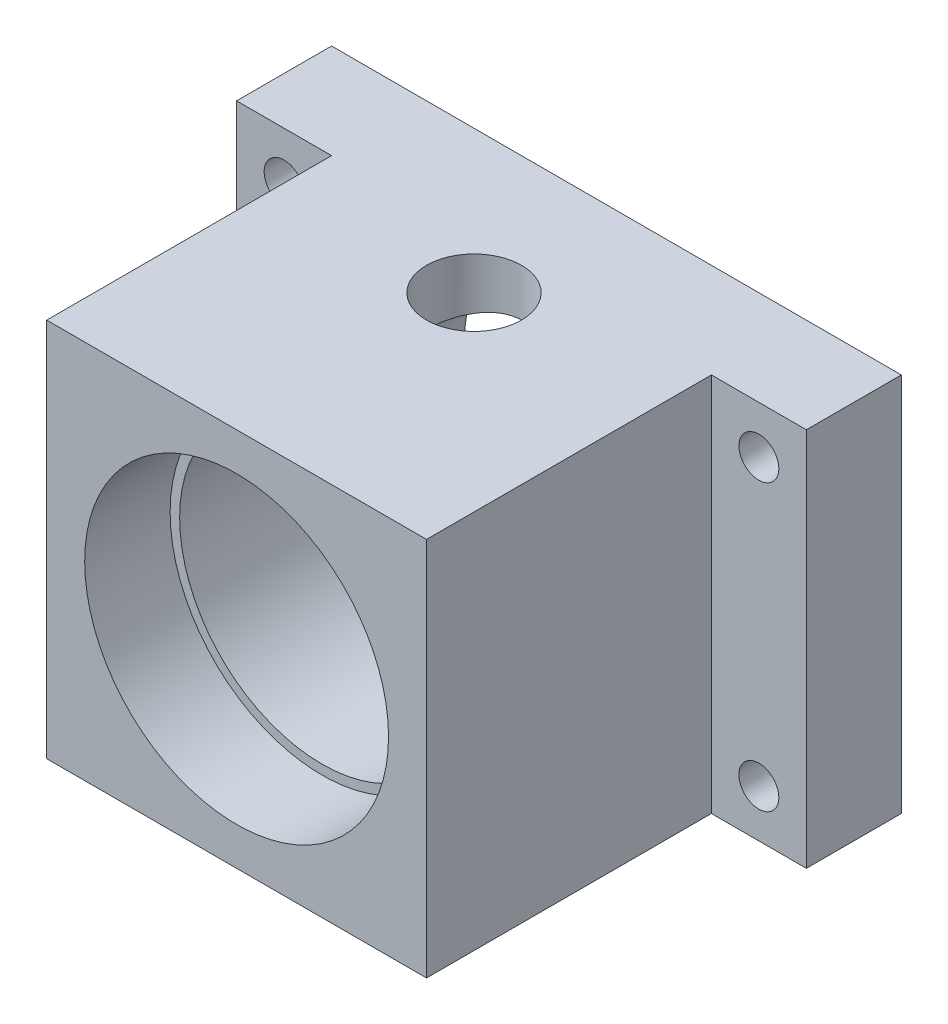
ISO-10303-21;
HEADER;
FILE_DESCRIPTION(('STEP AP214'),'2;1');
FILE_NAME('part.step','',(''),(''),'','','');
FILE_SCHEMA(('AUTOMOTIVE_DESIGN { 1 0 10303 214 1 1 1 1 }'));
ENDSEC;
DATA;
#1=APPLICATION_CONTEXT('core data for automotive mechanical design processes');
#2=APPLICATION_PROTOCOL_DEFINITION('international standard','automotive_design',2000,#1);
#3=PRODUCT_CONTEXT('',#1,'mechanical');
#4=PRODUCT('Part','Part','',(#3));
#5=PRODUCT_RELATED_PRODUCT_CATEGORY('part','',(#4));
#6=PRODUCT_DEFINITION_FORMATION('','',#4);
#7=PRODUCT_DEFINITION_CONTEXT('part definition',#1,'design');
#8=PRODUCT_DEFINITION('design','',#6,#7);
#9=PRODUCT_DEFINITION_SHAPE('','',#8);
#10=(LENGTH_UNIT() NAMED_UNIT(*) SI_UNIT(.MILLI.,.METRE.));
#11=(NAMED_UNIT(*) PLANE_ANGLE_UNIT() SI_UNIT($,.RADIAN.));
#12=(NAMED_UNIT(*) SI_UNIT($,.STERADIAN.) SOLID_ANGLE_UNIT());
#13=UNCERTAINTY_MEASURE_WITH_UNIT(LENGTH_MEASURE(1.E-05),#10,'distance_accuracy_value','');
#14=(GEOMETRIC_REPRESENTATION_CONTEXT(3) GLOBAL_UNCERTAINTY_ASSIGNED_CONTEXT((#13)) GLOBAL_UNIT_ASSIGNED_CONTEXT((#10,
#11,#12)) REPRESENTATION_CONTEXT('',''));
#15=CARTESIAN_POINT('',(0.,0.,0.));
#16=DIRECTION('',(0.,0.,1.));
#17=DIRECTION('',(1.,0.,0.));
#18=AXIS2_PLACEMENT_3D('',#15,#16,#17);
#19=CARTESIAN_POINT('',(30.,20.,40.));
#20=DIRECTION('',(0.,0.,-1.));
#21=DIRECTION('',(-1.,0.,0.));
#22=AXIS2_PLACEMENT_3D('',#19,#20,#21);
#23=CYLINDRICAL_SURFACE('',#22,15.);
#24=CARTESIAN_POINT('',(30.,20.,31.));
#25=DIRECTION('',(0.,0.,1.));
#26=DIRECTION('',(1.,0.,0.));
#27=AXIS2_PLACEMENT_3D('',#24,#25,#26);
#28=CIRCLE('',#27,15.);
#29=CARTESIAN_POINT('',(45.,20.,31.));
#30=VERTEX_POINT('',#29);
#31=EDGE_CURVE('E188',#30,#30,#28,.T.);
#32=ORIENTED_EDGE('',*,*,#31,.T.);
#33=EDGE_LOOP('',(#32));
#34=FACE_BOUND('',#33,.T.);
#35=CARTESIAN_POINT('',(30.,35.,20.));
#36=CARTESIAN_POINT('',(30.2728168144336,35.0000007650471,20.0000012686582));
#37=CARTESIAN_POINT('',(30.5456259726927,34.9924884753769,19.977598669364));
#38=CARTESIAN_POINT('',(31.0832088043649,34.9632605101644,19.8888544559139));
#39=CARTESIAN_POINT('',(31.3479816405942,34.941543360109,19.8225082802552));
#40=CARTESIAN_POINT('',(31.8616639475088,34.8862653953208,19.6484037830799));
#41=CARTESIAN_POINT('',(32.1105991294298,34.8527243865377,19.5407146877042));
#42=CARTESIAN_POINT('',(32.586874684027,34.7772222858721,19.2872941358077));
#43=CARTESIAN_POINT('',(32.8142107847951,34.7352595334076,19.1415551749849));
#44=CARTESIAN_POINT('',(33.2487083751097,34.6457047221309,18.8108709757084));
#45=CARTESIAN_POINT('',(33.4550185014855,34.5979778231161,18.6248438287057));
#46=CARTESIAN_POINT('',(33.8341634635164,34.5030157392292,18.221164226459));
#47=CARTESIAN_POINT('',(34.0069909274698,34.4557806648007,18.0035048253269));
#48=CARTESIAN_POINT('',(34.319124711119,34.3656666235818,17.5350744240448));
#49=CARTESIAN_POINT('',(34.4573242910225,34.3229519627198,17.2835313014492));
#50=CARTESIAN_POINT('',(34.6890943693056,34.2487652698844,16.7591195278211));
#51=CARTESIAN_POINT('',(34.7826784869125,34.2172898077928,16.4862574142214));
#52=CARTESIAN_POINT('',(34.9193673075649,34.1705651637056,15.9366338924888));
#53=CARTESIAN_POINT('',(34.9640672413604,34.1548047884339,15.6603139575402));
#54=CARTESIAN_POINT('',(35.0067056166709,34.1397828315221,15.103681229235));
#55=CARTESIAN_POINT('',(35.0046585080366,34.1405161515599,14.8233696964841));
#56=CARTESIAN_POINT('',(34.9550995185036,34.1579507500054,14.2803168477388));
#57=CARTESIAN_POINT('',(34.9096695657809,34.1739207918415,14.0173579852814));
#58=CARTESIAN_POINT('',(34.7780308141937,34.2188328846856,13.5030329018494));
#59=CARTESIAN_POINT('',(34.6918171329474,34.2477764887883,13.2516680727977));
#60=CARTESIAN_POINT('',(34.4796952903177,34.3158955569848,12.7629362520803));
#61=CARTESIAN_POINT('',(34.3531702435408,34.3552282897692,12.5258598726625));
#62=CARTESIAN_POINT('',(34.0644455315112,34.4396279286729,12.0756454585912));
#63=CARTESIAN_POINT('',(33.9022355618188,34.4846964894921,11.8625143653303));
#64=CARTESIAN_POINT('',(33.5367466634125,34.5783664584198,11.4545420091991));
#65=CARTESIAN_POINT('',(33.3317657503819,34.6270294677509,11.2612365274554));
#66=CARTESIAN_POINT('',(32.89169784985,34.7203469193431,10.9113436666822));
#67=CARTESIAN_POINT('',(32.656607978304,34.765000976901,10.7547598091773));
#68=CARTESIAN_POINT('',(32.1597380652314,34.8458553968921,10.4815184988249));
#69=CARTESIAN_POINT('',(31.8977163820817,34.8819675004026,10.3652725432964));
#70=CARTESIAN_POINT('',(31.3563454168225,34.9410283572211,10.1789841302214));
#71=CARTESIAN_POINT('',(31.0770021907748,34.9639816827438,10.1089256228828));
#72=CARTESIAN_POINT('',(30.5219191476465,34.9933813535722,10.0197216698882));
#73=CARTESIAN_POINT('',(30.2465479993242,35.0005000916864,9.99850095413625));
#74=CARTESIAN_POINT('',(29.6961246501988,34.9994451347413,10.0016633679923));
#75=CARTESIAN_POINT('',(29.4210724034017,34.9912740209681,10.0260387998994));
#76=CARTESIAN_POINT('',(28.8874006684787,34.9610012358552,10.1180595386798));
#77=CARTESIAN_POINT('',(28.6285359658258,34.9393099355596,10.1844310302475));
#78=CARTESIAN_POINT('',(28.1257202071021,34.8845923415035,10.3569672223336));
#79=CARTESIAN_POINT('',(27.881771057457,34.8515646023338,10.4631369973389));
#80=CARTESIAN_POINT('',(27.4085585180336,34.7764465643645,10.7153521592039));
#81=CARTESIAN_POINT('',(27.1798502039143,34.7341407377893,10.8623729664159));
#82=CARTESIAN_POINT('',(26.7496758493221,34.6452626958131,11.1909707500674));
#83=CARTESIAN_POINT('',(26.5482181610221,34.5986891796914,11.3725582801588));
#84=CARTESIAN_POINT('',(26.1687374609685,34.5038423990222,11.7748937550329));
#85=CARTESIAN_POINT('',(25.9921951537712,34.4555880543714,11.9970461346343));
#86=CARTESIAN_POINT('',(25.6787123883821,34.3649986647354,12.4688578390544));
#87=CARTESIAN_POINT('',(25.5417722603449,34.3226636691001,12.7185173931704));
#88=CARTESIAN_POINT('',(25.3120153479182,34.2491195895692,13.2383650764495));
#89=CARTESIAN_POINT('',(25.2191093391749,34.2178880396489,13.5085103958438));
#90=CARTESIAN_POINT('',(25.0805266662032,34.1705416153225,14.0618932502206));
#91=CARTESIAN_POINT('',(25.0348287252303,34.154419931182,14.3451248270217));
#92=CARTESIAN_POINT('',(24.9936185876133,34.1398929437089,14.9009854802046));
#93=CARTESIAN_POINT('',(24.995648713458,34.1406200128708,15.1734117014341));
#94=CARTESIAN_POINT('',(25.0437885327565,34.1575634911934,15.7138253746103));
#95=CARTESIAN_POINT('',(25.0898956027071,34.1737789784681,15.9818130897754));
#96=CARTESIAN_POINT('',(25.2231409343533,34.2192262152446,16.5006783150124));
#97=CARTESIAN_POINT('',(25.3094832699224,34.2482049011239,16.7517841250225));
#98=CARTESIAN_POINT('',(25.5201031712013,34.3158199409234,17.2361370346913));
#99=CARTESIAN_POINT('',(25.644389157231,34.3544584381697,17.46938015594));
#100=CARTESIAN_POINT('',(25.9336965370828,34.4391414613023,17.9224183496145));
#101=CARTESIAN_POINT('',(26.1002587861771,34.4854355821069,18.1411825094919));
#102=CARTESIAN_POINT('',(26.4667855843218,34.5791678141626,18.548449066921));
#103=CARTESIAN_POINT('',(26.6667595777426,34.6266062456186,18.7369428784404));
#104=CARTESIAN_POINT('',(27.1037922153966,34.7195015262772,19.0857220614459));
#105=CARTESIAN_POINT('',(27.3419924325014,34.7648090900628,19.244621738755));
#106=CARTESIAN_POINT('',(27.8432132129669,34.8462995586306,19.5199521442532));
#107=CARTESIAN_POINT('',(28.1062274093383,34.8824847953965,19.6363937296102));
#108=CARTESIAN_POINT('',(28.6375317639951,34.9402757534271,19.8186081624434));
#109=CARTESIAN_POINT('',(28.905061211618,34.9624606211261,19.8864123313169));
#110=CARTESIAN_POINT('',(29.4483979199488,34.9923203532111,19.9771014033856));
#111=CARTESIAN_POINT('',(29.7242028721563,34.9999992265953,19.9999987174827));
#112=CARTESIAN_POINT('',(30.,35.,20.));
#113=B_SPLINE_CURVE_WITH_KNOTS('',3,(#35,#36,#37,#38,#39,#40,#41,#42,#43,#44,#45,#46,#47,#48,
#49,#50,#51,#52,#53,#54,#55,#56,#57,#58,#59,#60,#61,#62,#63,#64,#65,#66,#67,#68,#69,#70,#71,#72,
#73,#74,#75,#76,#77,#78,#79,#80,#81,#82,#83,#84,#85,#86,#87,#88,#89,#90,#91,#92,#93,#94,#95,#96,
#97,#98,#99,#100,#101,#102,#103,#104,#105,#106,#107,#108,#109,#110,#111,#112),.UNSPECIFIED.,.T.,
.F.,(4,2,2,2,2,2,2,2,2,2,2,2,2,2,2,2,2,2,2,2,2,2,2,2,2,2,2,2,2,2,2,2,2,2,2,2,2,2,4),(0.,
0.817435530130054,1.6349559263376,2.45111336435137,3.2674318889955,4.1092342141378,
4.95122166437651,5.81741924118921,6.68335223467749,7.52009628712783,8.3565816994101,
9.15484132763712,9.9531965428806,10.764408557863,11.5758551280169,12.4296652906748,
13.2835572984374,14.1459202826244,15.0079834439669,15.832679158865,16.6572356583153,
17.4579078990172,18.2586822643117,19.0805199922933,19.9026090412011,20.7620511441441,
21.6215004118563,22.479200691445,23.3365142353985,24.1497833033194,24.9630039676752,
25.7607793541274,26.5587319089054,27.3915033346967,28.2245105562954,29.0899830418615,
29.9552340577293,30.7818279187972,31.6081933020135),.UNSPECIFIED.);
#114=CARTESIAN_POINT('',(30.,35.,20.));
#115=VERTEX_POINT('',#114);
#116=EDGE_CURVE('E190',#115,#115,#113,.T.);
#117=ORIENTED_EDGE('',*,*,#116,.T.);
#118=EDGE_LOOP('',(#117));
#119=FACE_BOUND('',#118,.T.);
#120=CARTESIAN_POINT('',(30.,20.,9.));
#121=DIRECTION('',(0.,0.,-1.));
#122=DIRECTION('',(-1.,0.,0.));
#123=AXIS2_PLACEMENT_3D('',#120,#121,#122);
#124=CIRCLE('',#123,15.);
#125=CARTESIAN_POINT('',(15.,20.,9.));
#126=VERTEX_POINT('',#125);
#127=EDGE_CURVE('E37',#126,#126,#124,.T.);
#128=ORIENTED_EDGE('',*,*,#127,.T.);
#129=EDGE_LOOP('',(#128));
#130=FACE_BOUND('',#129,.T.);
#131=ADVANCED_FACE('F33',(#34,#119,#130),#23,.F.);
#132=CARTESIAN_POINT('',(0.,39.9999999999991,40.));
#133=DIRECTION('',(0.,0.,-1.));
#134=DIRECTION('',(-1.,0.,0.));
#135=AXIS2_PLACEMENT_3D('',#132,#133,#134);
#136=PLANE('',#135);
#137=CARTESIAN_POINT('',(30.,20.,40.));
#138=DIRECTION('',(0.,0.,1.));
#139=DIRECTION('',(1.,0.,0.));
#140=AXIS2_PLACEMENT_3D('',#137,#138,#139);
#141=CIRCLE('',#140,16.);
#142=CARTESIAN_POINT('',(46.,20.,40.));
#143=VERTEX_POINT('',#142);
#144=EDGE_CURVE('E196',#143,#143,#141,.T.);
#145=ORIENTED_EDGE('',*,*,#144,.F.);
#146=EDGE_LOOP('',(#145));
#147=FACE_BOUND('',#146,.T.);
#148=DIRECTION('',(0.,1.,0.));
#149=VECTOR('',#148,1.);
#150=CARTESIAN_POINT('',(50.,-9.08995101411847E-13,40.));
#151=LINE('',#150,#149);
#152=CARTESIAN_POINT('',(50.,-9.08995101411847E-13,40.));
#153=VERTEX_POINT('',#152);
#154=CARTESIAN_POINT('',(50.,39.9999999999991,40.));
#155=VERTEX_POINT('',#154);
#156=EDGE_CURVE('E111',#153,#155,#151,.T.);
#157=ORIENTED_EDGE('',*,*,#156,.T.);
#158=DIRECTION('',(-1.,0.,0.));
#159=VECTOR('',#158,1.);
#160=CARTESIAN_POINT('',(0.,39.9999999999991,40.));
#161=LINE('',#160,#159);
#162=CARTESIAN_POINT('',(10.,39.9999999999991,40.));
#163=VERTEX_POINT('',#162);
#164=EDGE_CURVE('E167',#155,#163,#161,.T.);
#165=ORIENTED_EDGE('',*,*,#164,.T.);
#166=DIRECTION('',(0.,1.,0.));
#167=VECTOR('',#166,1.);
#168=CARTESIAN_POINT('',(10.,-9.08995101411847E-13,40.));
#169=LINE('',#168,#167);
#170=CARTESIAN_POINT('',(10.,-9.08995101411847E-13,40.));
#171=VERTEX_POINT('',#170);
#172=EDGE_CURVE('E137',#171,#163,#169,.T.);
#173=ORIENTED_EDGE('',*,*,#172,.F.);
#174=DIRECTION('',(1.,0.,0.));
#175=VECTOR('',#174,1.);
#176=CARTESIAN_POINT('',(0.,0.,40.));
#177=LINE('',#176,#175);
#178=EDGE_CURVE('E165',#171,#153,#177,.T.);
#179=ORIENTED_EDGE('',*,*,#178,.T.);
#180=EDGE_LOOP('',(#157,#165,#173,#179));
#181=FACE_BOUND('',#180,.T.);
#182=ADVANCED_FACE('F236',(#147,#181),#136,.F.);
#183=CARTESIAN_POINT('',(0.,0.,40.));
#184=DIRECTION('',(1.,0.,0.));
#185=DIRECTION('',(0.,0.,-1.));
#186=AXIS2_PLACEMENT_3D('',#183,#184,#185);
#187=PLANE('',#186);
#188=DIRECTION('',(0.,1.,0.));
#189=VECTOR('',#188,1.);
#190=CARTESIAN_POINT('',(0.,-9.08995101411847E-13,10.));
#191=LINE('',#190,#189);
#192=CARTESIAN_POINT('',(0.,-9.08995101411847E-13,10.));
#193=VERTEX_POINT('',#192);
#194=CARTESIAN_POINT('',(0.,39.9999999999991,10.));
#195=VERTEX_POINT('',#194);
#196=EDGE_CURVE('E141',#193,#195,#191,.T.);
#197=ORIENTED_EDGE('',*,*,#196,.T.);
#198=DIRECTION('',(0.,0.,-1.));
#199=VECTOR('',#198,1.);
#200=CARTESIAN_POINT('',(0.,39.9999999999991,40.));
#201=LINE('',#200,#199);
#202=CARTESIAN_POINT('',(0.,39.9999999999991,0.));
#203=VERTEX_POINT('',#202);
#204=EDGE_CURVE('E171',#195,#203,#201,.T.);
#205=ORIENTED_EDGE('',*,*,#204,.T.);
#206=DIRECTION('',(0.,-1.,0.));
#207=VECTOR('',#206,1.);
#208=CARTESIAN_POINT('',(0.,0.,0.));
#209=LINE('',#208,#207);
#210=CARTESIAN_POINT('',(0.,0.,0.));
#211=VERTEX_POINT('',#210);
#212=EDGE_CURVE('E164',#203,#211,#209,.T.);
#213=ORIENTED_EDGE('',*,*,#212,.T.);
#214=DIRECTION('',(0.,0.,-1.));
#215=VECTOR('',#214,1.);
#216=CARTESIAN_POINT('',(0.,0.,40.));
#217=LINE('',#216,#215);
#218=EDGE_CURVE('E12',#193,#211,#217,.T.);
#219=ORIENTED_EDGE('',*,*,#218,.F.);
#220=EDGE_LOOP('',(#197,#205,#213,#219));
#221=FACE_BOUND('',#220,.T.);
#222=ADVANCED_FACE('F35',(#221),#187,.F.);
#223=CARTESIAN_POINT('',(0.,0.,40.));
#224=DIRECTION('',(0.,1.,0.));
#225=DIRECTION('',(0.,0.,1.));
#226=AXIS2_PLACEMENT_3D('',#223,#224,#225);
#227=PLANE('',#226);
#228=DIRECTION('',(0.,0.,1.));
#229=VECTOR('',#228,1.);
#230=CARTESIAN_POINT('',(10.,-9.08995101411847E-13,40.));
#231=LINE('',#230,#229);
#232=CARTESIAN_POINT('',(10.,-9.08995101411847E-13,9.99999999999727));
#233=VERTEX_POINT('',#232);
#234=EDGE_CURVE('E105',#233,#171,#231,.T.);
#235=ORIENTED_EDGE('',*,*,#234,.F.);
#236=DIRECTION('',(1.,0.,-2.72872002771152E-13));
#237=VECTOR('',#236,1.);
#238=CARTESIAN_POINT('',(0.,-9.08995101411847E-13,10.));
#239=LINE('',#238,#237);
#240=EDGE_CURVE('E120',#193,#233,#239,.T.);
#241=ORIENTED_EDGE('',*,*,#240,.F.);
#242=ORIENTED_EDGE('',*,*,#218,.T.);
#243=DIRECTION('',(1.,0.,0.));
#244=VECTOR('',#243,1.);
#245=CARTESIAN_POINT('',(0.,0.,0.));
#246=LINE('',#245,#244);
#247=CARTESIAN_POINT('',(60.,0.,0.));
#248=VERTEX_POINT('',#247);
#249=EDGE_CURVE('E174',#211,#248,#246,.T.);
#250=ORIENTED_EDGE('',*,*,#249,.T.);
#251=DIRECTION('',(0.,0.,-1.));
#252=VECTOR('',#251,1.);
#253=CARTESIAN_POINT('',(60.,0.,40.));
#254=LINE('',#253,#252);
#255=CARTESIAN_POINT('',(60.,-9.08995101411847E-13,10.));
#256=VERTEX_POINT('',#255);
#257=EDGE_CURVE('E42',#256,#248,#254,.T.);
#258=ORIENTED_EDGE('',*,*,#257,.F.);
#259=DIRECTION('',(1.,0.,0.));
#260=VECTOR('',#259,1.);
#261=CARTESIAN_POINT('',(50.,-9.08995101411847E-13,10.));
#262=LINE('',#261,#260);
#263=CARTESIAN_POINT('',(50.,-9.08995101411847E-13,10.));
#264=VERTEX_POINT('',#263);
#265=EDGE_CURVE('E101',#264,#256,#262,.T.);
#266=ORIENTED_EDGE('',*,*,#265,.F.);
#267=DIRECTION('',(0.,0.,-1.));
#268=VECTOR('',#267,1.);
#269=CARTESIAN_POINT('',(50.,-9.08995101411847E-13,40.));
#270=LINE('',#269,#268);
#271=EDGE_CURVE('E108',#153,#264,#270,.T.);
#272=ORIENTED_EDGE('',*,*,#271,.F.);
#273=ORIENTED_EDGE('',*,*,#178,.F.);
#274=EDGE_LOOP('',(#235,#241,#242,#250,#258,#266,#272,#273));
#275=FACE_BOUND('',#274,.T.);
#276=ADVANCED_FACE('F118',(#275),#227,.F.);
#277=CARTESIAN_POINT('',(60.,0.,40.));
#278=DIRECTION('',(-1.,0.,0.));
#279=DIRECTION('',(0.,0.,1.));
#280=AXIS2_PLACEMENT_3D('',#277,#278,#279);
#281=PLANE('',#280);
#282=DIRECTION('',(0.,1.,0.));
#283=VECTOR('',#282,1.);
#284=CARTESIAN_POINT('',(60.,-9.08995101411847E-13,10.));
#285=LINE('',#284,#283);
#286=CARTESIAN_POINT('',(60.,39.9999999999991,10.));
#287=VERTEX_POINT('',#286);
#288=EDGE_CURVE('E58',#256,#287,#285,.T.);
#289=ORIENTED_EDGE('',*,*,#288,.F.);
#290=ORIENTED_EDGE('',*,*,#257,.T.);
#291=DIRECTION('',(0.,1.,0.));
#292=VECTOR('',#291,1.);
#293=CARTESIAN_POINT('',(60.,0.,0.));
#294=LINE('',#293,#292);
#295=CARTESIAN_POINT('',(60.,39.9999999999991,0.));
#296=VERTEX_POINT('',#295);
#297=EDGE_CURVE('E176',#248,#296,#294,.T.);
#298=ORIENTED_EDGE('',*,*,#297,.T.);
#299=DIRECTION('',(0.,0.,-1.));
#300=VECTOR('',#299,1.);
#301=CARTESIAN_POINT('',(60.,39.9999999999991,40.));
#302=LINE('',#301,#300);
#303=EDGE_CURVE('E182',#287,#296,#302,.T.);
#304=ORIENTED_EDGE('',*,*,#303,.F.);
#305=EDGE_LOOP('',(#289,#290,#298,#304));
#306=FACE_BOUND('',#305,.T.);
#307=ADVANCED_FACE('F256',(#306),#281,.F.);
#308=CARTESIAN_POINT('',(0.,39.9999999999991,40.));
#309=DIRECTION('',(0.,-1.,0.));
#310=DIRECTION('',(0.,0.,-1.));
#311=AXIS2_PLACEMENT_3D('',#308,#309,#310);
#312=PLANE('',#311);
#313=CARTESIAN_POINT('',(30.,39.9999999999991,15.));
#314=DIRECTION('',(0.,1.,0.));
#315=DIRECTION('',(0.,0.,1.));
#316=AXIS2_PLACEMENT_3D('',#313,#314,#315);
#317=CIRCLE('',#316,5.);
#318=CARTESIAN_POINT('',(30.,39.9999999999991,20.));
#319=VERTEX_POINT('',#318);
#320=EDGE_CURVE('E129',#319,#319,#317,.T.);
#321=ORIENTED_EDGE('',*,*,#320,.F.);
#322=EDGE_LOOP('',(#321));
#323=FACE_BOUND('',#322,.T.);
#324=DIRECTION('',(0.,0.,1.));
#325=VECTOR('',#324,1.);
#326=CARTESIAN_POINT('',(10.,39.9999999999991,40.));
#327=LINE('',#326,#325);
#328=CARTESIAN_POINT('',(10.,39.9999999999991,9.99999999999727));
#329=VERTEX_POINT('',#328);
#330=EDGE_CURVE('E50',#329,#163,#327,.T.);
#331=ORIENTED_EDGE('',*,*,#330,.T.);
#332=ORIENTED_EDGE('',*,*,#164,.F.);
#333=DIRECTION('',(0.,0.,-1.));
#334=VECTOR('',#333,1.);
#335=CARTESIAN_POINT('',(50.,39.9999999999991,40.));
#336=LINE('',#335,#334);
#337=CARTESIAN_POINT('',(50.,39.9999999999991,10.));
#338=VERTEX_POINT('',#337);
#339=EDGE_CURVE('E127',#155,#338,#336,.T.);
#340=ORIENTED_EDGE('',*,*,#339,.T.);
#341=DIRECTION('',(1.,0.,0.));
#342=VECTOR('',#341,1.);
#343=CARTESIAN_POINT('',(50.,39.9999999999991,10.));
#344=LINE('',#343,#342);
#345=EDGE_CURVE('E102',#338,#287,#344,.T.);
#346=ORIENTED_EDGE('',*,*,#345,.T.);
#347=ORIENTED_EDGE('',*,*,#303,.T.);
#348=DIRECTION('',(-1.,0.,0.));
#349=VECTOR('',#348,1.);
#350=CARTESIAN_POINT('',(0.,39.9999999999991,0.));
#351=LINE('',#350,#349);
#352=EDGE_CURVE('E168',#296,#203,#351,.T.);
#353=ORIENTED_EDGE('',*,*,#352,.T.);
#354=ORIENTED_EDGE('',*,*,#204,.F.);
#355=DIRECTION('',(1.,0.,-2.72872002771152E-13));
#356=VECTOR('',#355,1.);
#357=CARTESIAN_POINT('',(0.,39.9999999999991,10.));
#358=LINE('',#357,#356);
#359=EDGE_CURVE('E131',#195,#329,#358,.T.);
#360=ORIENTED_EDGE('',*,*,#359,.T.);
#361=EDGE_LOOP('',(#331,#332,#340,#346,#347,#353,#354,#360));
#362=FACE_BOUND('',#361,.T.);
#363=ADVANCED_FACE('F253',(#323,#362),#312,.F.);
#364=CARTESIAN_POINT('',(5.,35.,40.));
#365=DIRECTION('',(0.,0.,-1.));
#366=DIRECTION('',(-1.,0.,0.));
#367=AXIS2_PLACEMENT_3D('',#364,#365,#366);
#368=CYLINDRICAL_SURFACE('',#367,2.1);
#369=CARTESIAN_POINT('',(5.,35.,0.));
#370=DIRECTION('',(0.,0.,1.));
#371=DIRECTION('',(1.,0.,0.));
#372=AXIS2_PLACEMENT_3D('',#369,#370,#371);
#373=CIRCLE('',#372,2.1);
#374=CARTESIAN_POINT('',(7.1,35.,0.));
#375=VERTEX_POINT('',#374);
#376=EDGE_CURVE('E161',#375,#375,#373,.T.);
#377=ORIENTED_EDGE('',*,*,#376,.F.);
#378=EDGE_LOOP('',(#377));
#379=FACE_BOUND('',#378,.T.);
#380=CARTESIAN_POINT('',(5.,35.,9.99999999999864));
#381=DIRECTION('',(2.72872002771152E-13,0.,1.));
#382=DIRECTION('',(1.,0.,-2.72872002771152E-13));
#383=AXIS2_PLACEMENT_3D('',#380,#381,#382);
#384=CIRCLE('',#383,2.1);
#385=CARTESIAN_POINT('',(7.1,35.,9.99999999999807));
#386=VERTEX_POINT('',#385);
#387=EDGE_CURVE('E149',#386,#386,#384,.T.);
#388=ORIENTED_EDGE('',*,*,#387,.T.);
#389=EDGE_LOOP('',(#388));
#390=FACE_BOUND('',#389,.T.);
#391=ADVANCED_FACE('F245',(#379,#390),#368,.F.);
#392=CARTESIAN_POINT('',(5.,5.,40.));
#393=DIRECTION('',(0.,0.,-1.));
#394=DIRECTION('',(-1.,0.,0.));
#395=AXIS2_PLACEMENT_3D('',#392,#393,#394);
#396=CYLINDRICAL_SURFACE('',#395,2.1);
#397=CARTESIAN_POINT('',(5.,5.,0.));
#398=DIRECTION('',(0.,0.,1.));
#399=DIRECTION('',(1.,0.,0.));
#400=AXIS2_PLACEMENT_3D('',#397,#398,#399);
#401=CIRCLE('',#400,2.1);
#402=CARTESIAN_POINT('',(7.1,5.,0.));
#403=VERTEX_POINT('',#402);
#404=EDGE_CURVE('E158',#403,#403,#401,.T.);
#405=ORIENTED_EDGE('',*,*,#404,.F.);
#406=EDGE_LOOP('',(#405));
#407=FACE_BOUND('',#406,.T.);
#408=CARTESIAN_POINT('',(5.,5.,9.99999999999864));
#409=DIRECTION('',(2.72872002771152E-13,0.,1.));
#410=DIRECTION('',(1.,0.,-2.72872002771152E-13));
#411=AXIS2_PLACEMENT_3D('',#408,#409,#410);
#412=CIRCLE('',#411,2.1);
#413=CARTESIAN_POINT('',(7.1,5.,9.99999999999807));
#414=VERTEX_POINT('',#413);
#415=EDGE_CURVE('E148',#414,#414,#412,.T.);
#416=ORIENTED_EDGE('',*,*,#415,.T.);
#417=EDGE_LOOP('',(#416));
#418=FACE_BOUND('',#417,.T.);
#419=ADVANCED_FACE('F301',(#407,#418),#396,.F.);
#420=CARTESIAN_POINT('',(55.,5.,40.));
#421=DIRECTION('',(0.,0.,-1.));
#422=DIRECTION('',(-1.,0.,0.));
#423=AXIS2_PLACEMENT_3D('',#420,#421,#422);
#424=CYLINDRICAL_SURFACE('',#423,2.1);
#425=CARTESIAN_POINT('',(55.,5.,0.));
#426=DIRECTION('',(0.,0.,1.));
#427=DIRECTION('',(1.,0.,0.));
#428=AXIS2_PLACEMENT_3D('',#425,#426,#427);
#429=CIRCLE('',#428,2.1);
#430=CARTESIAN_POINT('',(57.1,5.,0.));
#431=VERTEX_POINT('',#430);
#432=EDGE_CURVE('E155',#431,#431,#429,.T.);
#433=ORIENTED_EDGE('',*,*,#432,.F.);
#434=EDGE_LOOP('',(#433));
#435=FACE_BOUND('',#434,.T.);
#436=CARTESIAN_POINT('',(55.,5.,10.));
#437=DIRECTION('',(0.,0.,1.));
#438=DIRECTION('',(1.,0.,0.));
#439=AXIS2_PLACEMENT_3D('',#436,#437,#438);
#440=CIRCLE('',#439,2.1);
#441=CARTESIAN_POINT('',(57.1,5.,10.));
#442=VERTEX_POINT('',#441);
#443=EDGE_CURVE('E145',#442,#442,#440,.T.);
#444=ORIENTED_EDGE('',*,*,#443,.T.);
#445=EDGE_LOOP('',(#444));
#446=FACE_BOUND('',#445,.T.);
#447=ADVANCED_FACE('F298',(#435,#446),#424,.F.);
#448=CARTESIAN_POINT('',(55.,35.,40.));
#449=DIRECTION('',(0.,0.,-1.));
#450=DIRECTION('',(-1.,0.,0.));
#451=AXIS2_PLACEMENT_3D('',#448,#449,#450);
#452=CYLINDRICAL_SURFACE('',#451,2.1);
#453=CARTESIAN_POINT('',(55.,35.,0.));
#454=DIRECTION('',(0.,0.,1.));
#455=DIRECTION('',(1.,0.,0.));
#456=AXIS2_PLACEMENT_3D('',#453,#454,#455);
#457=CIRCLE('',#456,2.1);
#458=CARTESIAN_POINT('',(57.1,35.,0.));
#459=VERTEX_POINT('',#458);
#460=EDGE_CURVE('E152',#459,#459,#457,.T.);
#461=ORIENTED_EDGE('',*,*,#460,.F.);
#462=EDGE_LOOP('',(#461));
#463=FACE_BOUND('',#462,.T.);
#464=CARTESIAN_POINT('',(55.,35.,10.));
#465=DIRECTION('',(0.,0.,1.));
#466=DIRECTION('',(1.,0.,0.));
#467=AXIS2_PLACEMENT_3D('',#464,#465,#466);
#468=CIRCLE('',#467,2.1);
#469=CARTESIAN_POINT('',(57.1,35.,10.));
#470=VERTEX_POINT('',#469);
#471=EDGE_CURVE('E136',#470,#470,#468,.T.);
#472=ORIENTED_EDGE('',*,*,#471,.T.);
#473=EDGE_LOOP('',(#472));
#474=FACE_BOUND('',#473,.T.);
#475=ADVANCED_FACE('F251',(#463,#474),#452,.F.);
#476=CARTESIAN_POINT('',(0.,39.9999999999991,0.));
#477=DIRECTION('',(0.,0.,-1.));
#478=DIRECTION('',(-1.,0.,0.));
#479=AXIS2_PLACEMENT_3D('',#476,#477,#478);
#480=PLANE('',#479);
#481=CARTESIAN_POINT('',(30.,20.,0.));
#482=DIRECTION('',(0.,0.,-1.));
#483=DIRECTION('',(-1.,0.,0.));
#484=AXIS2_PLACEMENT_3D('',#481,#482,#483);
#485=CIRCLE('',#484,16.);
#486=CARTESIAN_POINT('',(14.,20.,0.));
#487=VERTEX_POINT('',#486);
#488=EDGE_CURVE('E203',#487,#487,#485,.T.);
#489=ORIENTED_EDGE('',*,*,#488,.F.);
#490=EDGE_LOOP('',(#489));
#491=FACE_BOUND('',#490,.T.);
#492=ORIENTED_EDGE('',*,*,#432,.T.);
#493=EDGE_LOOP('',(#492));
#494=FACE_BOUND('',#493,.T.);
#495=ORIENTED_EDGE('',*,*,#376,.T.);
#496=EDGE_LOOP('',(#495));
#497=FACE_BOUND('',#496,.T.);
#498=ORIENTED_EDGE('',*,*,#212,.F.);
#499=ORIENTED_EDGE('',*,*,#352,.F.);
#500=ORIENTED_EDGE('',*,*,#297,.F.);
#501=ORIENTED_EDGE('',*,*,#249,.F.);
#502=EDGE_LOOP('',(#498,#499,#500,#501));
#503=FACE_BOUND('',#502,.T.);
#504=ORIENTED_EDGE('',*,*,#404,.T.);
#505=EDGE_LOOP('',(#504));
#506=FACE_BOUND('',#505,.T.);
#507=ORIENTED_EDGE('',*,*,#460,.T.);
#508=EDGE_LOOP('',(#507));
#509=FACE_BOUND('',#508,.T.);
#510=ADVANCED_FACE('F248',(#491,#494,#497,#503,#506,#509),#480,.T.);
#511=CARTESIAN_POINT('',(50.,-9.08995101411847E-13,10.));
#512=DIRECTION('',(0.,0.,1.));
#513=DIRECTION('',(1.,0.,0.));
#514=AXIS2_PLACEMENT_3D('',#511,#512,#513);
#515=PLANE('',#514);
#516=ORIENTED_EDGE('',*,*,#443,.F.);
#517=EDGE_LOOP('',(#516));
#518=FACE_BOUND('',#517,.T.);
#519=ORIENTED_EDGE('',*,*,#471,.F.);
#520=EDGE_LOOP('',(#519));
#521=FACE_BOUND('',#520,.T.);
#522=ORIENTED_EDGE('',*,*,#345,.F.);
#523=DIRECTION('',(0.,1.,0.));
#524=VECTOR('',#523,1.);
#525=CARTESIAN_POINT('',(50.,-9.08995101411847E-13,10.));
#526=LINE('',#525,#524);
#527=EDGE_CURVE('E97',#264,#338,#526,.T.);
#528=ORIENTED_EDGE('',*,*,#527,.F.);
#529=ORIENTED_EDGE('',*,*,#265,.T.);
#530=ORIENTED_EDGE('',*,*,#288,.T.);
#531=EDGE_LOOP('',(#522,#528,#529,#530));
#532=FACE_BOUND('',#531,.T.);
#533=ADVANCED_FACE('F99',(#518,#521,#532),#515,.T.);
#534=CARTESIAN_POINT('',(50.,-9.08995101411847E-13,40.));
#535=DIRECTION('',(1.,0.,0.));
#536=DIRECTION('',(0.,0.,-1.));
#537=AXIS2_PLACEMENT_3D('',#534,#535,#536);
#538=PLANE('',#537);
#539=ORIENTED_EDGE('',*,*,#339,.F.);
#540=ORIENTED_EDGE('',*,*,#156,.F.);
#541=ORIENTED_EDGE('',*,*,#271,.T.);
#542=ORIENTED_EDGE('',*,*,#527,.T.);
#543=EDGE_LOOP('',(#539,#540,#541,#542));
#544=FACE_BOUND('',#543,.T.);
#545=ADVANCED_FACE('F109',(#544),#538,.T.);
#546=CARTESIAN_POINT('',(10.,-9.08995101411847E-13,40.));
#547=DIRECTION('',(-1.,0.,0.));
#548=DIRECTION('',(0.,0.,1.));
#549=AXIS2_PLACEMENT_3D('',#546,#547,#548);
#550=PLANE('',#549);
#551=ORIENTED_EDGE('',*,*,#330,.F.);
#552=DIRECTION('',(0.,1.,0.));
#553=VECTOR('',#552,1.);
#554=CARTESIAN_POINT('',(10.,-9.08995101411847E-13,9.99999999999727));
#555=LINE('',#554,#553);
#556=EDGE_CURVE('E139',#233,#329,#555,.T.);
#557=ORIENTED_EDGE('',*,*,#556,.F.);
#558=ORIENTED_EDGE('',*,*,#234,.T.);
#559=ORIENTED_EDGE('',*,*,#172,.T.);
#560=EDGE_LOOP('',(#551,#557,#558,#559));
#561=FACE_BOUND('',#560,.T.);
#562=ADVANCED_FACE('F280',(#561),#550,.T.);
#563=CARTESIAN_POINT('',(0.,-9.08995101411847E-13,10.));
#564=DIRECTION('',(2.72872002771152E-13,0.,1.));
#565=DIRECTION('',(1.,0.,-2.72872002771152E-13));
#566=AXIS2_PLACEMENT_3D('',#563,#564,#565);
#567=PLANE('',#566);
#568=ORIENTED_EDGE('',*,*,#387,.F.);
#569=EDGE_LOOP('',(#568));
#570=FACE_BOUND('',#569,.T.);
#571=ORIENTED_EDGE('',*,*,#415,.F.);
#572=EDGE_LOOP('',(#571));
#573=FACE_BOUND('',#572,.T.);
#574=ORIENTED_EDGE('',*,*,#359,.F.);
#575=ORIENTED_EDGE('',*,*,#196,.F.);
#576=ORIENTED_EDGE('',*,*,#240,.T.);
#577=ORIENTED_EDGE('',*,*,#556,.T.);
#578=EDGE_LOOP('',(#574,#575,#576,#577));
#579=FACE_BOUND('',#578,.T.);
#580=ADVANCED_FACE('F279',(#570,#573,#579),#567,.T.);
#581=CARTESIAN_POINT('',(30.,-0.00100000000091,15.));
#582=DIRECTION('',(0.,1.,0.));
#583=DIRECTION('',(0.,0.,1.));
#584=AXIS2_PLACEMENT_3D('',#581,#582,#583);
#585=CYLINDRICAL_SURFACE('',#584,5.);
#586=ORIENTED_EDGE('',*,*,#116,.F.);
#587=EDGE_LOOP('',(#586));
#588=FACE_BOUND('',#587,.T.);
#589=ORIENTED_EDGE('',*,*,#320,.T.);
#590=EDGE_LOOP('',(#589));
#591=FACE_BOUND('',#590,.T.);
#592=ADVANCED_FACE('F211',(#588,#591),#585,.F.);
#593=CARTESIAN_POINT('',(30.,20.,31.));
#594=DIRECTION('',(0.,0.,1.));
#595=DIRECTION('',(1.,0.,0.));
#596=AXIS2_PLACEMENT_3D('',#593,#594,#595);
#597=CYLINDRICAL_SURFACE('',#596,16.);
#598=CARTESIAN_POINT('',(30.,20.,31.));
#599=DIRECTION('',(0.,0.,1.));
#600=DIRECTION('',(1.,0.,0.));
#601=AXIS2_PLACEMENT_3D('',#598,#599,#600);
#602=CIRCLE('',#601,16.);
#603=CARTESIAN_POINT('',(46.,20.,31.));
#604=VERTEX_POINT('',#603);
#605=EDGE_CURVE('E191',#604,#604,#602,.T.);
#606=ORIENTED_EDGE('',*,*,#605,.F.);
#607=EDGE_LOOP('',(#606));
#608=FACE_BOUND('',#607,.T.);
#609=ORIENTED_EDGE('',*,*,#144,.T.);
#610=EDGE_LOOP('',(#609));
#611=FACE_BOUND('',#610,.T.);
#612=ADVANCED_FACE('F216',(#608,#611),#597,.F.);
#613=CARTESIAN_POINT('',(30.,20.,31.));
#614=DIRECTION('',(0.,0.,1.));
#615=DIRECTION('',(1.,0.,0.));
#616=AXIS2_PLACEMENT_3D('',#613,#614,#615);
#617=PLANE('',#616);
#618=ORIENTED_EDGE('',*,*,#31,.F.);
#619=EDGE_LOOP('',(#618));
#620=FACE_BOUND('',#619,.T.);
#621=ORIENTED_EDGE('',*,*,#605,.T.);
#622=EDGE_LOOP('',(#621));
#623=FACE_BOUND('',#622,.T.);
#624=ADVANCED_FACE('F219',(#620,#623),#617,.T.);
#625=CARTESIAN_POINT('',(30.,20.,9.));
#626=DIRECTION('',(0.,0.,-1.));
#627=DIRECTION('',(-1.,0.,0.));
#628=AXIS2_PLACEMENT_3D('',#625,#626,#627);
#629=CYLINDRICAL_SURFACE('',#628,16.);
#630=CARTESIAN_POINT('',(30.,20.,9.));
#631=DIRECTION('',(0.,0.,-1.));
#632=DIRECTION('',(-1.,0.,0.));
#633=AXIS2_PLACEMENT_3D('',#630,#631,#632);
#634=CIRCLE('',#633,16.);
#635=CARTESIAN_POINT('',(14.,20.,9.));
#636=VERTEX_POINT('',#635);
#637=EDGE_CURVE('E436',#636,#636,#634,.T.);
#638=ORIENTED_EDGE('',*,*,#637,.F.);
#639=EDGE_LOOP('',(#638));
#640=FACE_BOUND('',#639,.T.);
#641=ORIENTED_EDGE('',*,*,#488,.T.);
#642=EDGE_LOOP('',(#641));
#643=FACE_BOUND('',#642,.T.);
#644=ADVANCED_FACE('F223',(#640,#643),#629,.F.);
#645=CARTESIAN_POINT('',(30.,20.,9.));
#646=DIRECTION('',(0.,0.,-1.));
#647=DIRECTION('',(-1.,0.,0.));
#648=AXIS2_PLACEMENT_3D('',#645,#646,#647);
#649=PLANE('',#648);
#650=ORIENTED_EDGE('',*,*,#127,.F.);
#651=EDGE_LOOP('',(#650));
#652=FACE_BOUND('',#651,.T.);
#653=ORIENTED_EDGE('',*,*,#637,.T.);
#654=EDGE_LOOP('',(#653));
#655=FACE_BOUND('',#654,.T.);
#656=ADVANCED_FACE('F227',(#652,#655),#649,.T.);
#657=CLOSED_SHELL('',(#131,#182,#222,#276,#307,#363,#391,#419,#447,#475,#510,#533,#545,#562,
#580,#592,#612,#624,#644,#656));
#658=MANIFOLD_SOLID_BREP('B2',#657);
#659=ADVANCED_BREP_SHAPE_REPRESENTATION('',(#18,#658),#14);
#660=SHAPE_DEFINITION_REPRESENTATION(#9,#659);
ENDSEC;
END-ISO-10303-21;
